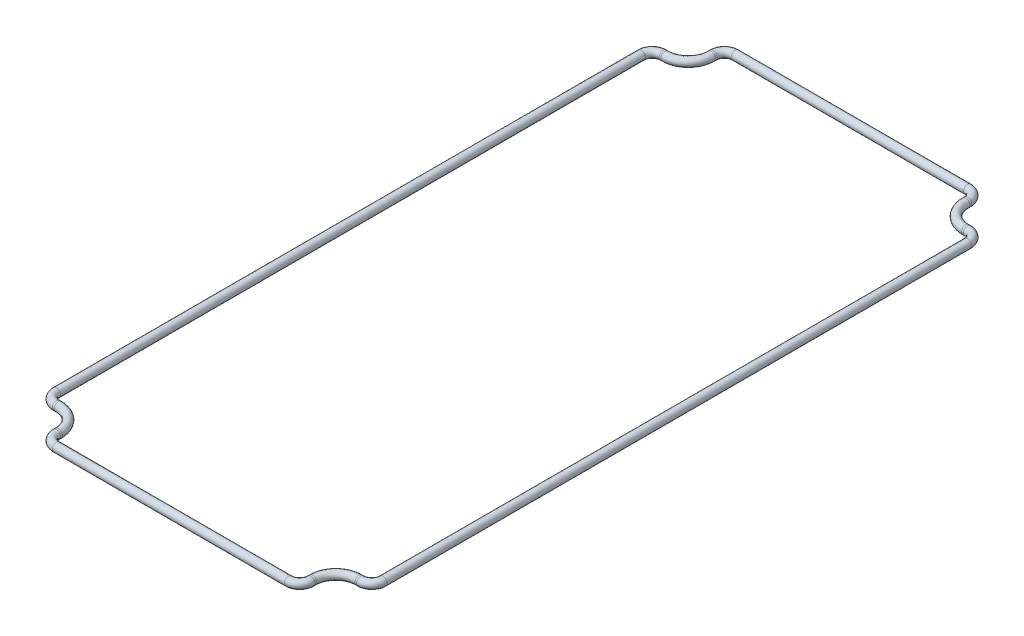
from build123d import *

# Parameters (mm, degrees)
SKETCH1_R = 1.190625


with BuildPart() as part:
    # Base-Sweep: sweep along a path in Sketch3
    with BuildLine(Plane(origin=(0, 26.035, 0), x_dir=(-1, 0, 0), z_dir=(0, 1, 0))) as base_sweep_path:
        Line((-36.2467, 93.63664), (-36.2467, 93.09816))
        ThreePointArc((-36.2467, 93.09816), (-38.180222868, 88.430222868), (-42.84816, 86.4967))
        Line((-42.84816, 86.4967), (-43.38664, 86.4967))
        ThreePointArc((-43.38664, 86.4967), (-45.611947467, 85.574947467), (-46.5337, 83.34964))
        Line((-46.5337, 83.34964), (-46.5337, -83.34964))
        ThreePointArc((-46.5337, -83.34964), (-45.611947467, -85.574947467), (-43.38664, -86.4967))
        Line((-43.38664, -86.4967), (-42.84816, -86.4967))
        ThreePointArc((-42.84816, -86.4967), (-38.180222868, -88.430222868), (-36.2467, -93.09816))
        Line((-36.2467, -93.09816), (-36.2467, -93.63664))
        ThreePointArc((-36.2467, -93.63664), (-35.324947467, -95.861947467), (-33.09964, -96.7837))
        Line((-33.09964, -96.7837), (33.09964, -96.7837))
        ThreePointArc((33.09964, -96.7837), (35.324947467, -95.861947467), (36.2467, -93.63664))
        Line((36.2467, -93.63664), (36.2467, -93.09816))
        ThreePointArc((36.2467, -93.09816), (38.180222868, -88.430222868), (42.84816, -86.4967))
        Line((42.84816, -86.4967), (43.38664, -86.4967))
        ThreePointArc((43.38664, -86.4967), (45.611947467, -85.574947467), (46.5337, -83.34964))
        Line((46.5337, -83.34964), (46.5337, 83.34964))
        ThreePointArc((46.5337, 83.34964), (45.611947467, 85.574947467), (43.38664, 86.4967))
        Line((43.38664, 86.4967), (42.84816, 86.4967))
        ThreePointArc((42.84816, 86.4967), (38.180222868, 88.430222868), (36.2467, 93.09816))
        Line((36.2467, 93.09816), (36.2467, 93.63664))
        ThreePointArc((36.2467, 93.63664), (35.324947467, 95.861947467), (33.09964, 96.7837))
        Line((33.09964, 96.7837), (-33.09964, 96.7837))
        ThreePointArc((-33.09964, 96.7837), (-35.324947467, 95.861947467), (-36.2467, 93.63664))
    # Sketch1 → Base-Sweep (sweep)
    with BuildSketch(Plane.XY):
        with Locations((46.5337, 26.035)):
            Circle(SKETCH1_R)
    sweep(path=base_sweep_path.line)


solid = part.part
